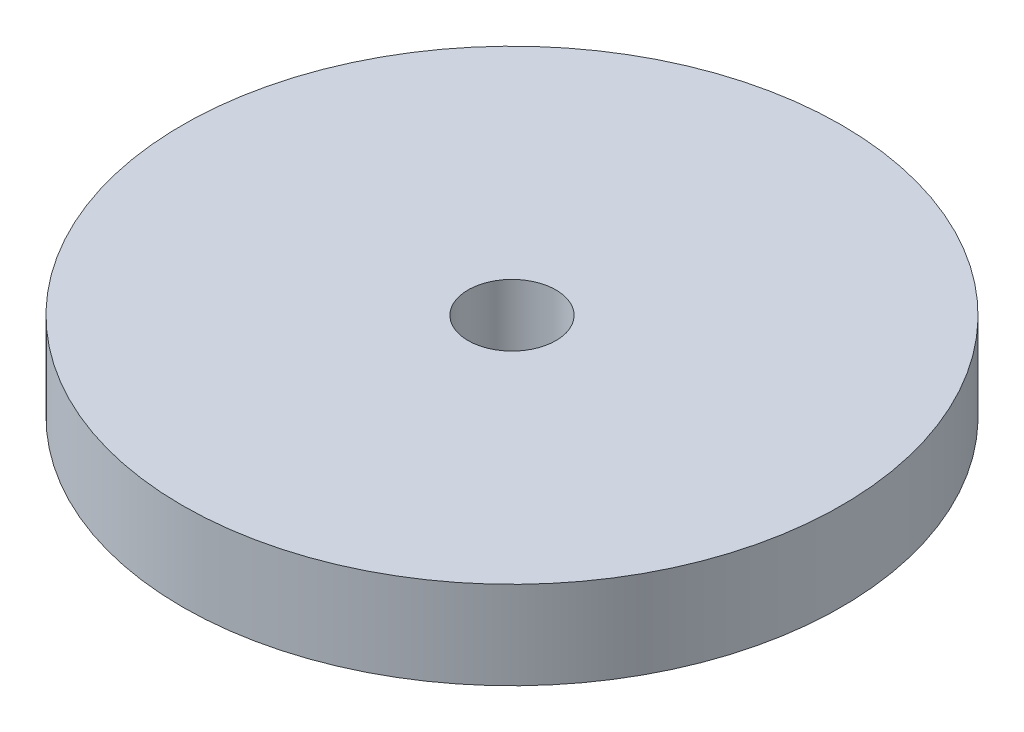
ISO-10303-21;
HEADER;
FILE_DESCRIPTION(('STEP AP214'),'2;1');
FILE_NAME('part.step','',(''),(''),'','','');
FILE_SCHEMA(('AUTOMOTIVE_DESIGN { 1 0 10303 214 1 1 1 1 }'));
ENDSEC;
DATA;
#1=APPLICATION_CONTEXT('core data for automotive mechanical design processes');
#2=APPLICATION_PROTOCOL_DEFINITION('international standard','automotive_design',2000,#1);
#3=PRODUCT_CONTEXT('',#1,'mechanical');
#4=PRODUCT('Part','Part','',(#3));
#5=PRODUCT_RELATED_PRODUCT_CATEGORY('part','',(#4));
#6=PRODUCT_DEFINITION_FORMATION('','',#4);
#7=PRODUCT_DEFINITION_CONTEXT('part definition',#1,'design');
#8=PRODUCT_DEFINITION('design','',#6,#7);
#9=PRODUCT_DEFINITION_SHAPE('','',#8);
#10=(LENGTH_UNIT() NAMED_UNIT(*) SI_UNIT(.MILLI.,.METRE.));
#11=(NAMED_UNIT(*) PLANE_ANGLE_UNIT() SI_UNIT($,.RADIAN.));
#12=(NAMED_UNIT(*) SI_UNIT($,.STERADIAN.) SOLID_ANGLE_UNIT());
#13=UNCERTAINTY_MEASURE_WITH_UNIT(LENGTH_MEASURE(1.E-05),#10,'distance_accuracy_value','');
#14=(GEOMETRIC_REPRESENTATION_CONTEXT(3) GLOBAL_UNCERTAINTY_ASSIGNED_CONTEXT((#13)) GLOBAL_UNIT_ASSIGNED_CONTEXT((#10,
#11,#12)) REPRESENTATION_CONTEXT('',''));
#15=CARTESIAN_POINT('',(0.,0.,0.));
#16=DIRECTION('',(0.,0.,1.));
#17=DIRECTION('',(1.,0.,0.));
#18=AXIS2_PLACEMENT_3D('',#15,#16,#17);
#19=CARTESIAN_POINT('',(0.,6.,0.));
#20=DIRECTION('',(0.,1.,0.));
#21=DIRECTION('',(0.,0.,1.));
#22=AXIS2_PLACEMENT_3D('',#19,#20,#21);
#23=PLANE('',#22);
#24=CARTESIAN_POINT('',(0.,6.,0.));
#25=DIRECTION('',(0.,1.,0.));
#26=DIRECTION('',(0.,0.,1.));
#27=AXIS2_PLACEMENT_3D('',#24,#25,#26);
#28=CIRCLE('',#27,22.5);
#29=CARTESIAN_POINT('',(0.,6.,22.5));
#30=VERTEX_POINT('',#29);
#31=EDGE_CURVE('E10',#30,#30,#28,.T.);
#32=ORIENTED_EDGE('',*,*,#31,.T.);
#33=EDGE_LOOP('',(#32));
#34=FACE_BOUND('',#33,.T.);
#35=CARTESIAN_POINT('',(0.,6.,0.));
#36=DIRECTION('',(0.,1.,0.));
#37=DIRECTION('',(0.,0.,1.));
#38=AXIS2_PLACEMENT_3D('',#35,#36,#37);
#39=CIRCLE('',#38,3.);
#40=CARTESIAN_POINT('',(0.,6.,3.));
#41=VERTEX_POINT('',#40);
#42=EDGE_CURVE('E43',#41,#41,#39,.T.);
#43=ORIENTED_EDGE('',*,*,#42,.F.);
#44=EDGE_LOOP('',(#43));
#45=FACE_BOUND('',#44,.T.);
#46=ADVANCED_FACE('F32',(#34,#45),#23,.T.);
#47=CARTESIAN_POINT('',(0.,0.,0.));
#48=DIRECTION('',(0.,1.,0.));
#49=DIRECTION('',(0.,0.,1.));
#50=AXIS2_PLACEMENT_3D('',#47,#48,#49);
#51=PLANE('',#50);
#52=CARTESIAN_POINT('',(0.,0.,0.));
#53=DIRECTION('',(0.,1.,0.));
#54=DIRECTION('',(0.,0.,1.));
#55=AXIS2_PLACEMENT_3D('',#52,#53,#54);
#56=CIRCLE('',#55,22.5);
#57=CARTESIAN_POINT('',(0.,0.,22.5));
#58=VERTEX_POINT('',#57);
#59=EDGE_CURVE('E39',#58,#58,#56,.T.);
#60=ORIENTED_EDGE('',*,*,#59,.F.);
#61=EDGE_LOOP('',(#60));
#62=FACE_BOUND('',#61,.T.);
#63=CARTESIAN_POINT('',(0.,0.,0.));
#64=DIRECTION('',(0.,1.,0.));
#65=DIRECTION('',(0.,0.,1.));
#66=AXIS2_PLACEMENT_3D('',#63,#64,#65);
#67=CIRCLE('',#66,3.);
#68=CARTESIAN_POINT('',(0.,0.,3.));
#69=VERTEX_POINT('',#68);
#70=EDGE_CURVE('E47',#69,#69,#67,.T.);
#71=ORIENTED_EDGE('',*,*,#70,.T.);
#72=EDGE_LOOP('',(#71));
#73=FACE_BOUND('',#72,.T.);
#74=ADVANCED_FACE('F53',(#62,#73),#51,.F.);
#75=CARTESIAN_POINT('',(0.,6.,0.));
#76=DIRECTION('',(0.,-1.,0.));
#77=DIRECTION('',(0.,0.,-1.));
#78=AXIS2_PLACEMENT_3D('',#75,#76,#77);
#79=CYLINDRICAL_SURFACE('',#78,22.5);
#80=ORIENTED_EDGE('',*,*,#31,.F.);
#81=EDGE_LOOP('',(#80));
#82=FACE_BOUND('',#81,.T.);
#83=ORIENTED_EDGE('',*,*,#59,.T.);
#84=EDGE_LOOP('',(#83));
#85=FACE_BOUND('',#84,.T.);
#86=ADVANCED_FACE('F34',(#82,#85),#79,.T.);
#87=CARTESIAN_POINT('',(0.,6.,0.));
#88=DIRECTION('',(0.,-1.,0.));
#89=DIRECTION('',(0.,0.,-1.));
#90=AXIS2_PLACEMENT_3D('',#87,#88,#89);
#91=CYLINDRICAL_SURFACE('',#90,3.);
#92=ORIENTED_EDGE('',*,*,#42,.T.);
#93=EDGE_LOOP('',(#92));
#94=FACE_BOUND('',#93,.T.);
#95=ORIENTED_EDGE('',*,*,#70,.F.);
#96=EDGE_LOOP('',(#95));
#97=FACE_BOUND('',#96,.T.);
#98=ADVANCED_FACE('F55',(#94,#97),#91,.F.);
#99=CLOSED_SHELL('',(#46,#74,#86,#98));
#100=MANIFOLD_SOLID_BREP('B2',#99);
#101=ADVANCED_BREP_SHAPE_REPRESENTATION('',(#18,#100),#14);
#102=SHAPE_DEFINITION_REPRESENTATION(#9,#101);
ENDSEC;
END-ISO-10303-21;
